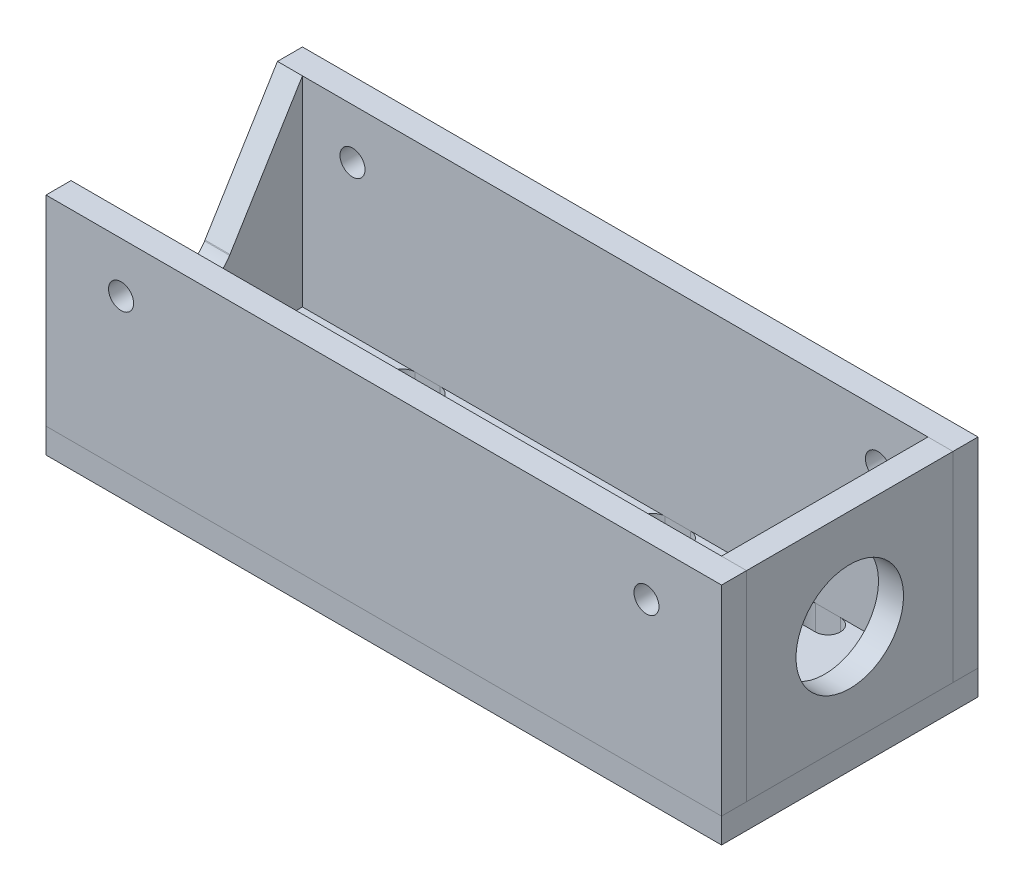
from build123d import *

# Parameters (mm, degrees)
BOSS_EXTRUDE1_DEPTH   = 6.35
SKETCH2_W             = 171.45
SKETCH2_H             = 6.35
BOSS_EXTRUDE2_DEPTH   = 50.8
BOSS_EXTRUDE2_2_DEPTH = 50.8
SKETCH3_W             = 6.35
SKETCH3_H             = 52.3875
BOSS_EXTRUDE3_DEPTH   = 50.8
BOSS_EXTRUDE3_2_DEPTH = 50.8
SKETCH4_R             = 9.095704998
CUT_EXTRUDE1_DEPTH    = 6.35
SKETCH5_R             = 13.643557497
CUT_EXTRUDE2_DEPTH    = 6.35
SKETCH6_R             = 3.175
CUT_EXTRUDE3_DEPTH    = 6.35
SKETCH7_R             = 3.175
CUT_EXTRUDE4_DEPTH    = 6.35
CUT_EXTRUDE5_DEPTH    = 6.35
CUT_EXTRUDE6_DEPTH    = 6.35


with BuildPart() as part:
    # Sketch1 → Boss-Extrude1 (new body)
    with BuildSketch(Plane(origin=(0, 0, 0), x_dir=(1, 0, 0), z_dir=(0, 1, 0))):
        Polygon((-6.35, 52.3875), (-6.35, 0), (-6.35, -6.35), (165.1, -6.35), (165.1, 0), (165.1, 52.3875), (165.1, 58.7375), (-6.35, 58.7375), align=None)
    extrude(amount=BOSS_EXTRUDE1_DEPTH)

    # Sketch9 → Cut-Extrude6 (cut)
    with BuildSketch(Plane(origin=(0, 6.35, 0), x_dir=(1, 0, 0), z_dir=(0, 1, 0))):
        with BuildLine():
            Line((136.525, 0), (130.175, 0))
            ThreePointArc((130.175, 0), (127, 3.175), (130.175, 6.35))
            Line((130.175, 6.35), (136.525, 6.35))
            ThreePointArc((136.525, 6.35), (139.7, 3.175), (136.525, 0))
        make_face()
        with BuildLine():
            Line((98.425, 0), (92.075, 0))
            ThreePointArc((92.075, 0), (88.9, 3.175), (92.075, 6.35))
            Line((92.075, 6.35), (98.425, 6.35))
            ThreePointArc((98.425, 6.35), (101.6, 3.175), (98.425, 0))
        make_face()
        with BuildLine():
            Line((34.925, 0), (28.575, 0))
            ThreePointArc((28.575, 0), (25.4, 3.175), (28.575, 6.35))
            Line((28.575, 6.35), (34.925, 6.35))
            ThreePointArc((34.925, 6.35), (38.1, 3.175), (34.925, 0))
        make_face()
        with BuildLine():
            Line((136.525, 52.3875), (130.175, 52.3875))
            ThreePointArc((130.175, 52.3875), (127, 49.2125), (130.175, 46.0375))
            Line((130.175, 46.0375), (136.525, 46.0375))
            ThreePointArc((136.525, 46.0375), (139.7, 49.2125), (136.525, 52.3875))
        make_face()
        with BuildLine():
            Line((98.425, 52.3875), (92.075, 52.3875))
            ThreePointArc((92.075, 52.3875), (88.9, 49.2125), (92.075, 46.0375))
            Line((92.075, 46.0375), (98.425, 46.0375))
            ThreePointArc((98.425, 46.0375), (101.6, 49.2125), (98.425, 52.3875))
        make_face()
        with BuildLine():
            Line((34.925, 52.3875), (28.575, 52.3875))
            ThreePointArc((28.575, 52.3875), (25.4, 49.2125), (28.575, 46.0375))
            Line((28.575, 46.0375), (34.925, 46.0375))
            ThreePointArc((34.925, 46.0375), (38.1, 49.2125), (34.925, 52.3875))
        make_face()
    extrude(amount=-CUT_EXTRUDE6_DEPTH, mode=Mode.SUBTRACT)


with BuildPart() as body_2:
    # Sketch2 → Boss-Extrude2 (new body)
    with BuildSketch(Plane(origin=(0, 6.35, 0), x_dir=(1, 0, 0), z_dir=(0, 1, 0))):
        with Locations((79.375, 55.5625)):
            Rectangle(SKETCH2_W, SKETCH2_H)
    extrude(amount=BOSS_EXTRUDE2_DEPTH)

    # Sketch7 → Cut-Extrude4 (cut)
    with BuildSketch(Plane(origin=(0, 0, -58.7375), x_dir=(-1, 0, 0), z_dir=(0, 0, -1))):
        with Locations(Location((-12.7, 44.45, 0), (0, 0, 180))):
            Circle(SKETCH7_R)
        with Locations(Location((-146.05, 44.45, 0), (0, 0, 180))):
            Circle(SKETCH7_R)
    extrude(amount=-CUT_EXTRUDE4_DEPTH, mode=Mode.SUBTRACT)


with BuildPart() as body_3:
    # Sketch2 → Boss-Extrude2 2 (new body)
    with BuildSketch(Plane(origin=(0, 6.35, 0), x_dir=(1, 0, 0), z_dir=(0, 1, 0))):
        with Locations((79.375, -3.175)):
            Rectangle(SKETCH2_W, SKETCH2_H)
    extrude(amount=BOSS_EXTRUDE2_2_DEPTH)

    # Sketch6 → Cut-Extrude3 (cut)
    with BuildSketch(Plane.XY.offset(6.35)):
        with Locations((12.7, 44.45)):
            Circle(SKETCH6_R)
        with Locations((146.05, 44.45)):
            Circle(SKETCH6_R)
    extrude(amount=-CUT_EXTRUDE3_DEPTH, mode=Mode.SUBTRACT)


with BuildPart() as body_4:
    # Sketch3 → Boss-Extrude3 (new body)
    with BuildSketch(Plane(origin=(0, 6.35, 0), x_dir=(1, 0, 0), z_dir=(0, 1, 0))):
        with Locations((-3.175, 26.19375)):
            Rectangle(SKETCH3_W, SKETCH3_H)
    extrude(amount=BOSS_EXTRUDE3_DEPTH)

    # Sketch4 → Cut-Extrude1 (cut)
    with BuildSketch(Plane.ZY.offset(6.35)):
        with Locations((-26.19375, 31.75)):
            Circle(SKETCH4_R)
    extrude(amount=-CUT_EXTRUDE1_DEPTH, mode=Mode.SUBTRACT)

    # Sketch8 → Cut-Extrude5 (cut)
    with BuildSketch(Plane.ZY.offset(6.35)):
        with BuildLine():
            Line((-52.3875, 57.15), (0, 57.15))
            Line((0, 57.15), (-18.596297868, 26.748943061))
            ThreePointArc((-18.596297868, 26.748943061), (-26.297828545, 22.602301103), (-33.903020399, 26.923096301))
            Line((-33.903020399, 26.923096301), (-52.3875, 57.15))
        make_face()
    extrude(amount=-CUT_EXTRUDE5_DEPTH, mode=Mode.SUBTRACT)


with BuildPart() as body_5:
    # Sketch3 → Boss-Extrude3 2 (new body)
    with BuildSketch(Plane(origin=(0, 6.35, 0), x_dir=(1, 0, 0), z_dir=(0, 1, 0))):
        with Locations((161.925, 26.19375)):
            Rectangle(SKETCH3_W, SKETCH3_H)
    extrude(amount=BOSS_EXTRUDE3_2_DEPTH)

    # Sketch5 → Cut-Extrude2 (cut)
    with BuildSketch(Plane(origin=(165.1, 0, 0), x_dir=(0, 0, -1), z_dir=(1, 0, 0))):
        with Locations((26.19375, 31.75)):
            Circle(SKETCH5_R)
    extrude(amount=-CUT_EXTRUDE2_DEPTH, mode=Mode.SUBTRACT)


solid = Compound([part.part, body_2.part, body_3.part, body_4.part, body_5.part])
